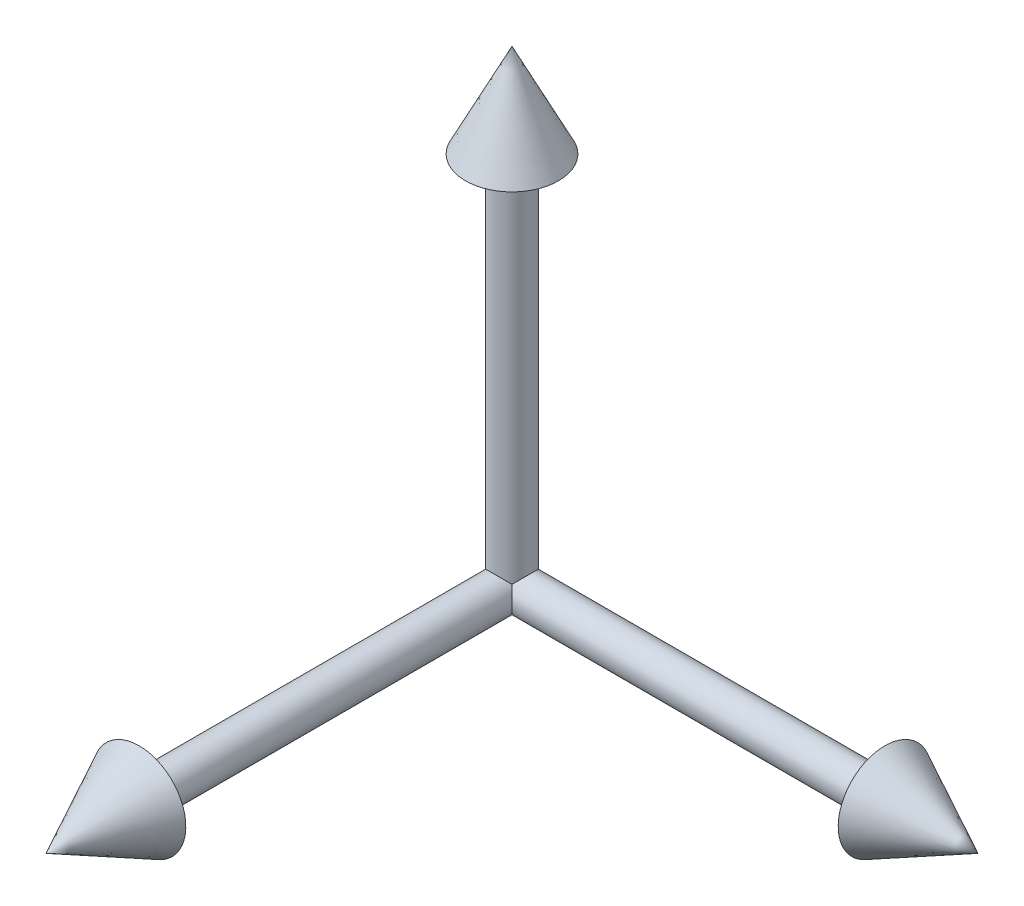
ISO-10303-21;
HEADER;
FILE_DESCRIPTION(('STEP AP214'),'2;1');
FILE_NAME('part.step','',(''),(''),'','','');
FILE_SCHEMA(('AUTOMOTIVE_DESIGN { 1 0 10303 214 1 1 1 1 }'));
ENDSEC;
DATA;
#1=APPLICATION_CONTEXT('core data for automotive mechanical design processes');
#2=APPLICATION_PROTOCOL_DEFINITION('international standard','automotive_design',2000,#1);
#3=PRODUCT_CONTEXT('',#1,'mechanical');
#4=PRODUCT('Part','Part','',(#3));
#5=PRODUCT_RELATED_PRODUCT_CATEGORY('part','',(#4));
#6=PRODUCT_DEFINITION_FORMATION('','',#4);
#7=PRODUCT_DEFINITION_CONTEXT('part definition',#1,'design');
#8=PRODUCT_DEFINITION('design','',#6,#7);
#9=PRODUCT_DEFINITION_SHAPE('','',#8);
#10=(LENGTH_UNIT() NAMED_UNIT(*) SI_UNIT(.MILLI.,.METRE.));
#11=(NAMED_UNIT(*) PLANE_ANGLE_UNIT() SI_UNIT($,.RADIAN.));
#12=(NAMED_UNIT(*) SI_UNIT($,.STERADIAN.) SOLID_ANGLE_UNIT());
#13=UNCERTAINTY_MEASURE_WITH_UNIT(LENGTH_MEASURE(1.E-05),#10,'distance_accuracy_value','');
#14=(GEOMETRIC_REPRESENTATION_CONTEXT(3) GLOBAL_UNCERTAINTY_ASSIGNED_CONTEXT((#13)) GLOBAL_UNIT_ASSIGNED_CONTEXT((#10,
#11,#12)) REPRESENTATION_CONTEXT('',''));
#15=CARTESIAN_POINT('',(0.,0.,0.));
#16=DIRECTION('',(0.,0.,1.));
#17=DIRECTION('',(1.,0.,0.));
#18=AXIS2_PLACEMENT_3D('',#15,#16,#17);
#19=CARTESIAN_POINT('',(0.,0.,0.));
#20=DIRECTION('',(1.,0.,0.));
#21=DIRECTION('',(0.,1.,0.));
#22=AXIS2_PLACEMENT_3D('',#19,#20,#21);
#23=PLANE('',#22);
#24=CARTESIAN_POINT('',(0.,0.,0.));
#25=DIRECTION('',(-1.,0.,0.));
#26=DIRECTION('',(0.,-1.,0.));
#27=AXIS2_PLACEMENT_3D('',#24,#25,#26);
#28=CIRCLE('',#27,10.);
#29=CARTESIAN_POINT('',(0.,0.,-10.));
#30=VERTEX_POINT('',#29);
#31=CARTESIAN_POINT('',(0.,-9.99999999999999,0.));
#32=VERTEX_POINT('',#31);
#33=EDGE_CURVE('E110',#30,#32,#28,.T.);
#34=ORIENTED_EDGE('',*,*,#33,.T.);
#35=DIRECTION('',(0.,1.,0.));
#36=VECTOR('',#35,1.);
#37=CARTESIAN_POINT('',(0.,0.,0.));
#38=LINE('',#37,#36);
#39=CARTESIAN_POINT('',(0.,0.,0.));
#40=VERTEX_POINT('',#39);
#41=EDGE_CURVE('E52',#32,#40,#38,.T.);
#42=ORIENTED_EDGE('',*,*,#41,.T.);
#43=DIRECTION('',(0.,0.,-1.));
#44=VECTOR('',#43,1.);
#45=CARTESIAN_POINT('',(0.,0.,0.));
#46=LINE('',#45,#44);
#47=EDGE_CURVE('E102',#40,#30,#46,.T.);
#48=ORIENTED_EDGE('',*,*,#47,.T.);
#49=EDGE_LOOP('',(#34,#42,#48));
#50=FACE_BOUND('',#49,.T.);
#51=ADVANCED_FACE('F31',(#50),#23,.F.);
#52=CARTESIAN_POINT('',(0.,0.,0.));
#53=DIRECTION('',(-1.,0.,0.));
#54=DIRECTION('',(0.,-1.,0.));
#55=AXIS2_PLACEMENT_3D('',#52,#53,#54);
#56=CYLINDRICAL_SURFACE('',#55,10.);
#57=CARTESIAN_POINT('',(0.,0.,0.));
#58=DIRECTION('',(-0.707106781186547,0.707106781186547,0.));
#59=DIRECTION('',(-0.707106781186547,-0.707106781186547,0.));
#60=AXIS2_PLACEMENT_3D('',#57,#58,#59);
#61=ELLIPSE('',#60,14.142135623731,10.);
#62=CARTESIAN_POINT('',(7.07106781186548,7.07106781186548,7.07106781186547));
#63=VERTEX_POINT('',#62);
#64=EDGE_CURVE('E38',#30,#63,#61,.F.);
#65=ORIENTED_EDGE('',*,*,#64,.T.);
#66=CARTESIAN_POINT('',(0.,0.,0.));
#67=DIRECTION('',(-0.707106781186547,0.,0.707106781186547));
#68=DIRECTION('',(-0.707106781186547,0.,-0.707106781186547));
#69=AXIS2_PLACEMENT_3D('',#66,#67,#68);
#70=ELLIPSE('',#69,14.1421356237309,10.);
#71=EDGE_CURVE('E45',#63,#32,#70,.F.);
#72=ORIENTED_EDGE('',*,*,#71,.T.);
#73=ORIENTED_EDGE('',*,*,#33,.F.);
#74=EDGE_LOOP('',(#65,#72,#73));
#75=FACE_BOUND('',#74,.T.);
#76=CARTESIAN_POINT('',(200.,0.,0.));
#77=DIRECTION('',(-1.,0.,0.));
#78=DIRECTION('',(0.,-1.,0.));
#79=AXIS2_PLACEMENT_3D('',#76,#77,#78);
#80=CIRCLE('',#79,10.);
#81=CARTESIAN_POINT('',(200.,-10.,0.));
#82=VERTEX_POINT('',#81);
#83=EDGE_CURVE('E107',#82,#82,#80,.T.);
#84=ORIENTED_EDGE('',*,*,#83,.T.);
#85=EDGE_LOOP('',(#84));
#86=FACE_BOUND('',#85,.T.);
#87=ADVANCED_FACE('F112',(#75,#86),#56,.T.);
#88=CARTESIAN_POINT('',(200.,10.,0.));
#89=DIRECTION('',(1.,0.,0.));
#90=DIRECTION('',(0.,1.,0.));
#91=AXIS2_PLACEMENT_3D('',#88,#89,#90);
#92=PLANE('',#91);
#93=ORIENTED_EDGE('',*,*,#83,.F.);
#94=EDGE_LOOP('',(#93));
#95=FACE_BOUND('',#94,.T.);
#96=CARTESIAN_POINT('',(200.,0.,0.));
#97=DIRECTION('',(-1.,0.,0.));
#98=DIRECTION('',(0.,-1.,0.));
#99=AXIS2_PLACEMENT_3D('',#96,#97,#98);
#100=CIRCLE('',#99,25.);
#101=CARTESIAN_POINT('',(200.,-25.,0.));
#102=VERTEX_POINT('',#101);
#103=EDGE_CURVE('E104',#102,#102,#100,.T.);
#104=ORIENTED_EDGE('',*,*,#103,.T.);
#105=EDGE_LOOP('',(#104));
#106=FACE_BOUND('',#105,.T.);
#107=ADVANCED_FACE('F127',(#95,#106),#92,.F.);
#108=CARTESIAN_POINT('',(250.,0.,0.));
#109=DIRECTION('',(-1.,0.,0.));
#110=DIRECTION('',(0.,-1.,0.));
#111=AXIS2_PLACEMENT_3D('',#108,#109,#110);
#112=CONICAL_SURFACE('',#111,0.,0.463647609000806);
#113=ORIENTED_EDGE('',*,*,#103,.F.);
#114=EDGE_LOOP('',(#113));
#115=FACE_BOUND('',#114,.T.);
#116=CARTESIAN_POINT('',(250.,0.,0.));
#117=VERTEX_POINT('',#116);
#118=VERTEX_LOOP('',#117);
#119=FACE_BOUND('',#118,.T.);
#120=ADVANCED_FACE('F131',(#115,#119),#112,.T.);
#121=CARTESIAN_POINT('',(0.,0.,0.));
#122=DIRECTION('',(0.,-1.,0.));
#123=DIRECTION('',(1.,0.,0.));
#124=AXIS2_PLACEMENT_3D('',#121,#122,#123);
#125=PLANE('',#124);
#126=DIRECTION('',(1.,0.,0.));
#127=VECTOR('',#126,1.);
#128=CARTESIAN_POINT('',(0.,0.,0.));
#129=LINE('',#128,#127);
#130=CARTESIAN_POINT('',(-9.99999999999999,0.,0.));
#131=VERTEX_POINT('',#130);
#132=EDGE_CURVE('E83',#131,#40,#129,.T.);
#133=ORIENTED_EDGE('',*,*,#132,.F.);
#134=CARTESIAN_POINT('',(0.,0.,0.));
#135=DIRECTION('',(0.,-1.,0.));
#136=DIRECTION('',(1.,0.,0.));
#137=AXIS2_PLACEMENT_3D('',#134,#135,#136);
#138=CIRCLE('',#137,10.);
#139=EDGE_CURVE('E99',#131,#30,#138,.T.);
#140=ORIENTED_EDGE('',*,*,#139,.T.);
#141=ORIENTED_EDGE('',*,*,#47,.F.);
#142=EDGE_LOOP('',(#133,#140,#141));
#143=FACE_BOUND('',#142,.T.);
#144=ADVANCED_FACE('F122',(#143),#125,.T.);
#145=CARTESIAN_POINT('',(0.,0.,0.));
#146=DIRECTION('',(0.,-1.,0.));
#147=DIRECTION('',(1.,0.,0.));
#148=AXIS2_PLACEMENT_3D('',#145,#146,#147);
#149=CYLINDRICAL_SURFACE('',#148,10.);
#150=CARTESIAN_POINT('',(0.,0.,0.));
#151=DIRECTION('',(0.,-0.707106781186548,0.707106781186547));
#152=DIRECTION('',(0.,-0.707106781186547,-0.707106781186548));
#153=AXIS2_PLACEMENT_3D('',#150,#151,#152);
#154=ELLIPSE('',#153,14.1421356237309,10.);
#155=EDGE_CURVE('E11',#63,#131,#154,.T.);
#156=ORIENTED_EDGE('',*,*,#155,.F.);
#157=ORIENTED_EDGE('',*,*,#64,.F.);
#158=ORIENTED_EDGE('',*,*,#139,.F.);
#159=EDGE_LOOP('',(#156,#157,#158));
#160=FACE_BOUND('',#159,.T.);
#161=CARTESIAN_POINT('',(0.,200.,0.));
#162=DIRECTION('',(0.,-1.,0.));
#163=DIRECTION('',(1.,0.,0.));
#164=AXIS2_PLACEMENT_3D('',#161,#162,#163);
#165=CIRCLE('',#164,10.);
#166=CARTESIAN_POINT('',(10.,200.,0.));
#167=VERTEX_POINT('',#166);
#168=EDGE_CURVE('E96',#167,#167,#165,.T.);
#169=ORIENTED_EDGE('',*,*,#168,.T.);
#170=EDGE_LOOP('',(#169));
#171=FACE_BOUND('',#170,.T.);
#172=ADVANCED_FACE('F140',(#160,#171),#149,.T.);
#173=CARTESIAN_POINT('',(25.,200.,0.));
#174=DIRECTION('',(0.,-1.,0.));
#175=DIRECTION('',(1.,0.,0.));
#176=AXIS2_PLACEMENT_3D('',#173,#174,#175);
#177=PLANE('',#176);
#178=CARTESIAN_POINT('',(0.,200.,0.));
#179=DIRECTION('',(0.,-1.,0.));
#180=DIRECTION('',(1.,0.,0.));
#181=AXIS2_PLACEMENT_3D('',#178,#179,#180);
#182=CIRCLE('',#181,25.);
#183=CARTESIAN_POINT('',(25.,200.,0.));
#184=VERTEX_POINT('',#183);
#185=EDGE_CURVE('E93',#184,#184,#182,.T.);
#186=ORIENTED_EDGE('',*,*,#185,.T.);
#187=EDGE_LOOP('',(#186));
#188=FACE_BOUND('',#187,.T.);
#189=ORIENTED_EDGE('',*,*,#168,.F.);
#190=EDGE_LOOP('',(#189));
#191=FACE_BOUND('',#190,.T.);
#192=ADVANCED_FACE('F143',(#188,#191),#177,.T.);
#193=CARTESIAN_POINT('',(0.,200.,0.));
#194=DIRECTION('',(0.,-1.,0.));
#195=DIRECTION('',(1.,0.,0.));
#196=AXIS2_PLACEMENT_3D('',#193,#194,#195);
#197=CONICAL_SURFACE('',#196,25.,0.463647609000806);
#198=CARTESIAN_POINT('',(0.,250.,0.));
#199=VERTEX_POINT('',#198);
#200=VERTEX_LOOP('',#199);
#201=FACE_BOUND('',#200,.T.);
#202=ORIENTED_EDGE('',*,*,#185,.F.);
#203=EDGE_LOOP('',(#202));
#204=FACE_BOUND('',#203,.T.);
#205=ADVANCED_FACE('F146',(#201,#204),#197,.T.);
#206=CARTESIAN_POINT('',(0.,0.,0.));
#207=DIRECTION('',(0.,0.,-1.));
#208=DIRECTION('',(0.,1.,0.));
#209=AXIS2_PLACEMENT_3D('',#206,#207,#208);
#210=PLANE('',#209);
#211=ORIENTED_EDGE('',*,*,#41,.F.);
#212=CARTESIAN_POINT('',(0.,0.,0.));
#213=DIRECTION('',(0.,0.,-1.));
#214=DIRECTION('',(0.,1.,0.));
#215=AXIS2_PLACEMENT_3D('',#212,#213,#214);
#216=CIRCLE('',#215,9.99999999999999);
#217=EDGE_CURVE('E86',#32,#131,#216,.T.);
#218=ORIENTED_EDGE('',*,*,#217,.T.);
#219=ORIENTED_EDGE('',*,*,#132,.T.);
#220=EDGE_LOOP('',(#211,#218,#219));
#221=FACE_BOUND('',#220,.T.);
#222=ADVANCED_FACE('F119',(#221),#210,.T.);
#223=CARTESIAN_POINT('',(0.,0.,0.));
#224=DIRECTION('',(0.,0.,-1.));
#225=DIRECTION('',(0.,1.,0.));
#226=AXIS2_PLACEMENT_3D('',#223,#224,#225);
#227=CYLINDRICAL_SURFACE('',#226,10.);
#228=CARTESIAN_POINT('',(0.,0.,200.));
#229=DIRECTION('',(0.,0.,-1.));
#230=DIRECTION('',(0.,1.,0.));
#231=AXIS2_PLACEMENT_3D('',#228,#229,#230);
#232=CIRCLE('',#231,10.);
#233=CARTESIAN_POINT('',(0.,9.99999999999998,200.));
#234=VERTEX_POINT('',#233);
#235=EDGE_CURVE('E81',#234,#234,#232,.T.);
#236=ORIENTED_EDGE('',*,*,#235,.T.);
#237=EDGE_LOOP('',(#236));
#238=FACE_BOUND('',#237,.T.);
#239=ORIENTED_EDGE('',*,*,#71,.F.);
#240=ORIENTED_EDGE('',*,*,#155,.T.);
#241=ORIENTED_EDGE('',*,*,#217,.F.);
#242=EDGE_LOOP('',(#239,#240,#241));
#243=FACE_BOUND('',#242,.T.);
#244=ADVANCED_FACE('F75',(#238,#243),#227,.T.);
#245=CARTESIAN_POINT('',(0.,0.,200.));
#246=DIRECTION('',(0.,0.,-1.));
#247=DIRECTION('',(0.,1.,0.));
#248=AXIS2_PLACEMENT_3D('',#245,#246,#247);
#249=CONICAL_SURFACE('',#248,25.,0.463647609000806);
#250=CARTESIAN_POINT('',(0.,0.,250.));
#251=VERTEX_POINT('',#250);
#252=VERTEX_LOOP('',#251);
#253=FACE_BOUND('',#252,.T.);
#254=CARTESIAN_POINT('',(0.,0.,200.));
#255=DIRECTION('',(0.,0.,-1.));
#256=DIRECTION('',(0.,1.,0.));
#257=AXIS2_PLACEMENT_3D('',#254,#255,#256);
#258=CIRCLE('',#257,25.);
#259=CARTESIAN_POINT('',(0.,25.,200.));
#260=VERTEX_POINT('',#259);
#261=EDGE_CURVE('E79',#260,#260,#258,.T.);
#262=ORIENTED_EDGE('',*,*,#261,.F.);
#263=EDGE_LOOP('',(#262));
#264=FACE_BOUND('',#263,.T.);
#265=ADVANCED_FACE('F71',(#253,#264),#249,.T.);
#266=CARTESIAN_POINT('',(0.,9.99999999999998,200.));
#267=DIRECTION('',(0.,0.,-1.));
#268=DIRECTION('',(0.,1.,0.));
#269=AXIS2_PLACEMENT_3D('',#266,#267,#268);
#270=PLANE('',#269);
#271=ORIENTED_EDGE('',*,*,#261,.T.);
#272=EDGE_LOOP('',(#271));
#273=FACE_BOUND('',#272,.T.);
#274=ORIENTED_EDGE('',*,*,#235,.F.);
#275=EDGE_LOOP('',(#274));
#276=FACE_BOUND('',#275,.T.);
#277=ADVANCED_FACE('F74',(#273,#276),#270,.T.);
#278=CLOSED_SHELL('',(#51,#87,#107,#120,#144,#172,#192,#205,#222,#244,#265,#277));
#279=MANIFOLD_SOLID_BREP('B2',#278);
#280=ADVANCED_BREP_SHAPE_REPRESENTATION('',(#18,#279),#14);
#281=SHAPE_DEFINITION_REPRESENTATION(#9,#280);
ENDSEC;
END-ISO-10303-21;
